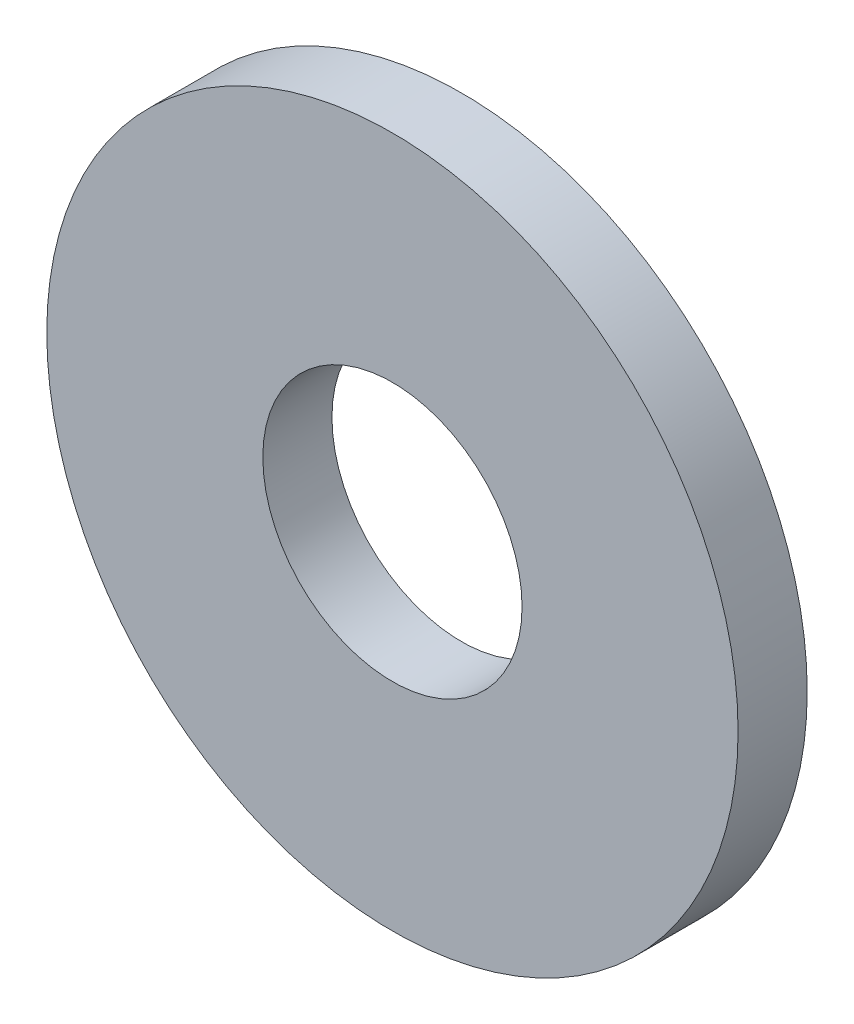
from build123d import *

# Parameters (mm, degrees)
ESQUISSE1_R      = 4
ESQUISSE1_R_2    = 1.5
EXTRUSION1_DEPTH = 0.8


with BuildPart() as part:
    # Esquisse1 → Extrusion1 (new body)
    with BuildSketch(Plane.XY):
        Circle(ESQUISSE1_R)
        Circle(ESQUISSE1_R_2, mode=Mode.SUBTRACT)
    extrude(amount=EXTRUSION1_DEPTH)


solid = part.part
